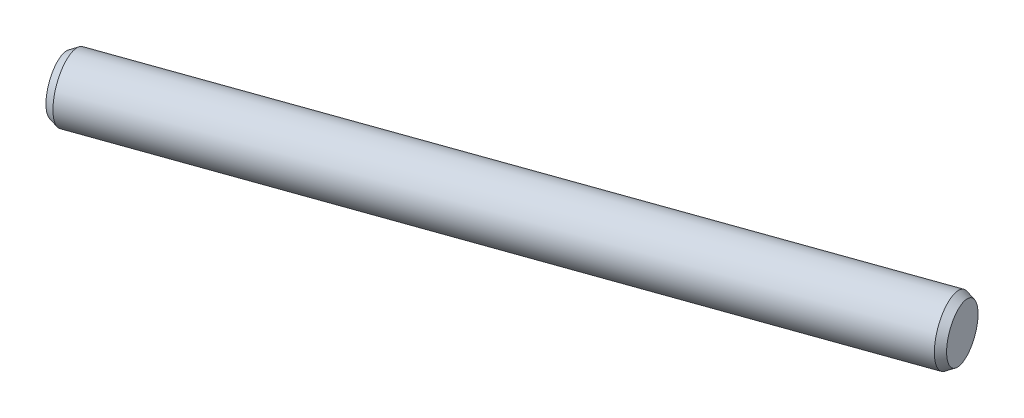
ISO-10303-21;
HEADER;
FILE_DESCRIPTION(('STEP AP214'),'2;1');
FILE_NAME('part.step','',(''),(''),'','','');
FILE_SCHEMA(('AUTOMOTIVE_DESIGN { 1 0 10303 214 1 1 1 1 }'));
ENDSEC;
DATA;
#1=APPLICATION_CONTEXT('core data for automotive mechanical design processes');
#2=APPLICATION_PROTOCOL_DEFINITION('international standard','automotive_design',2000,#1);
#3=PRODUCT_CONTEXT('',#1,'mechanical');
#4=PRODUCT('Part','Part','',(#3));
#5=PRODUCT_RELATED_PRODUCT_CATEGORY('part','',(#4));
#6=PRODUCT_DEFINITION_FORMATION('','',#4);
#7=PRODUCT_DEFINITION_CONTEXT('part definition',#1,'design');
#8=PRODUCT_DEFINITION('design','',#6,#7);
#9=PRODUCT_DEFINITION_SHAPE('','',#8);
#10=(LENGTH_UNIT() NAMED_UNIT(*) SI_UNIT(.MILLI.,.METRE.));
#11=(NAMED_UNIT(*) PLANE_ANGLE_UNIT() SI_UNIT($,.RADIAN.));
#12=(NAMED_UNIT(*) SI_UNIT($,.STERADIAN.) SOLID_ANGLE_UNIT());
#13=UNCERTAINTY_MEASURE_WITH_UNIT(LENGTH_MEASURE(1.E-05),#10,'distance_accuracy_value','');
#14=(GEOMETRIC_REPRESENTATION_CONTEXT(3) GLOBAL_UNCERTAINTY_ASSIGNED_CONTEXT((#13)) GLOBAL_UNIT_ASSIGNED_CONTEXT((#10,
#11,#12)) REPRESENTATION_CONTEXT('',''));
#15=CARTESIAN_POINT('',(0.,0.,0.));
#16=DIRECTION('',(0.,0.,1.));
#17=DIRECTION('',(1.,0.,0.));
#18=AXIS2_PLACEMENT_3D('',#15,#16,#17);
#19=CARTESIAN_POINT('',(10.355648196,-1.731860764,10.242100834));
#20=DIRECTION('',(-0.942641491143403,0.,0.333806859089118));
#21=DIRECTION('',(0.333806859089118,0.,0.942641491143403));
#22=AXIS2_PLACEMENT_3D('',#19,#20,#21);
#23=PLANE('',#22);
#24=CARTESIAN_POINT('',(10.9337551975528,0.,11.8746246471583));
#25=DIRECTION('',(0.942641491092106,0.,-0.333806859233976));
#26=DIRECTION('',(-0.333806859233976,0.,-0.942641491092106));
#27=AXIS2_PLACEMENT_3D('',#24,#25,#26);
#28=CIRCLE('',#27,1.71132486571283);
#29=CARTESIAN_POINT('',(10.3625032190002,0.,10.2614588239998));
#30=VERTEX_POINT('',#29);
#31=EDGE_CURVE('E19',#30,#30,#28,.F.);
#32=ORIENTED_EDGE('',*,*,#31,.T.);
#33=EDGE_LOOP('',(#32));
#34=FACE_BOUND('',#33,.T.);
#35=ADVANCED_FACE('F15',(#34),#23,.T.);
#36=CARTESIAN_POINT('',(10.9337551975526,0.,11.8746246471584));
#37=DIRECTION('',(0.942641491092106,0.,-0.333806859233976));
#38=DIRECTION('',(-0.333806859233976,0.,-0.942641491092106));
#39=AXIS2_PLACEMENT_3D('',#36,#37,#38);
#40=CONICAL_SURFACE('',#39,1.7113248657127,0.523598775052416);
#41=CARTESIAN_POINT('',(11.4050759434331,0.,11.7077212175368));
#42=DIRECTION('',(-0.942641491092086,0.,0.333806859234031));
#43=DIRECTION('',(0.333806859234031,0.,0.942641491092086));
#44=AXIS2_PLACEMENT_3D('',#41,#42,#43);
#45=CIRCLE('',#44,2.00000000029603);
#46=CARTESIAN_POINT('',(12.072689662,0.,13.5930042));
#47=VERTEX_POINT('',#46);
#48=EDGE_CURVE('E27',#47,#47,#45,.T.);
#49=ORIENTED_EDGE('',*,*,#48,.T.);
#50=EDGE_LOOP('',(#49));
#51=FACE_BOUND('',#50,.T.);
#52=ORIENTED_EDGE('',*,*,#31,.F.);
#53=EDGE_LOOP('',(#52));
#54=FACE_BOUND('',#53,.T.);
#55=ADVANCED_FACE('F37',(#51,#54),#40,.T.);
#56=CARTESIAN_POINT('',(54.5780562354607,0.,-3.58063293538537));
#57=DIRECTION('',(-0.942641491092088,0.,0.333806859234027));
#58=DIRECTION('',(0.333806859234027,0.,0.942641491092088));
#59=AXIS2_PLACEMENT_3D('',#56,#57,#58);
#60=CYLINDRICAL_SURFACE('',#59,2.00000000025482);
#61=ORIENTED_EDGE('',*,*,#48,.F.);
#62=EDGE_LOOP('',(#61));
#63=FACE_BOUND('',#62,.T.);
#64=CARTESIAN_POINT('',(54.5780562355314,0.,-3.58063293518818));
#65=DIRECTION('',(-0.942641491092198,0.,0.333806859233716));
#66=DIRECTION('',(0.333806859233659,0.,0.942641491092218));
#67=AXIS2_PLACEMENT_3D('',#64,#65,#66);
#68=CIRCLE('',#67,2.00000000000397);
#69=CARTESIAN_POINT('',(55.245669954,0.,-1.695349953));
#70=VERTEX_POINT('',#69);
#71=EDGE_CURVE('E23',#70,#70,#68,.T.);
#72=ORIENTED_EDGE('',*,*,#71,.T.);
#73=EDGE_LOOP('',(#72));
#74=FACE_BOUND('',#73,.T.);
#75=ADVANCED_FACE('F39',(#63,#74),#60,.T.);
#76=CARTESIAN_POINT('',(54.471269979,-1.731860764,-5.380060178));
#77=DIRECTION('',(-0.942641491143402,0.,0.33380685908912));
#78=DIRECTION('',(0.33380685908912,0.,0.942641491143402));
#79=AXIS2_PLACEMENT_3D('',#76,#77,#78);
#80=PLANE('',#79);
#81=CARTESIAN_POINT('',(55.0493769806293,0.,-3.74753636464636));
#82=DIRECTION('',(-0.942641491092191,0.,0.333806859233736));
#83=DIRECTION('',(0.333806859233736,0.,0.942641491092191));
#84=AXIS2_PLACEMENT_3D('',#81,#82,#83);
#85=CIRCLE('',#84,1.71132486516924);
#86=CARTESIAN_POINT('',(55.6206289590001,0.,-2.13437054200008));
#87=VERTEX_POINT('',#86);
#88=EDGE_CURVE('E10',#87,#87,#85,.F.);
#89=ORIENTED_EDGE('',*,*,#88,.T.);
#90=EDGE_LOOP('',(#89));
#91=FACE_BOUND('',#90,.T.);
#92=ADVANCED_FACE('F17',(#91),#80,.F.);
#93=CARTESIAN_POINT('',(55.0493769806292,0.,-3.74753636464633));
#94=DIRECTION('',(-0.942641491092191,0.,0.333806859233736));
#95=DIRECTION('',(0.333806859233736,0.,0.942641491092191));
#96=AXIS2_PLACEMENT_3D('',#93,#94,#95);
#97=CONICAL_SURFACE('',#96,1.71132486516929,0.523598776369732);
#98=ORIENTED_EDGE('',*,*,#88,.F.);
#99=EDGE_LOOP('',(#98));
#100=FACE_BOUND('',#99,.T.);
#101=ORIENTED_EDGE('',*,*,#71,.F.);
#102=EDGE_LOOP('',(#101));
#103=FACE_BOUND('',#102,.T.);
#104=ADVANCED_FACE('F49',(#100,#103),#97,.T.);
#105=CLOSED_SHELL('',(#35,#55,#75,#92,#104));
#106=MANIFOLD_SOLID_BREP('B1',#105);
#107=ADVANCED_BREP_SHAPE_REPRESENTATION('',(#18,#106),#14);
#108=SHAPE_DEFINITION_REPRESENTATION(#9,#107);
ENDSEC;
END-ISO-10303-21;
